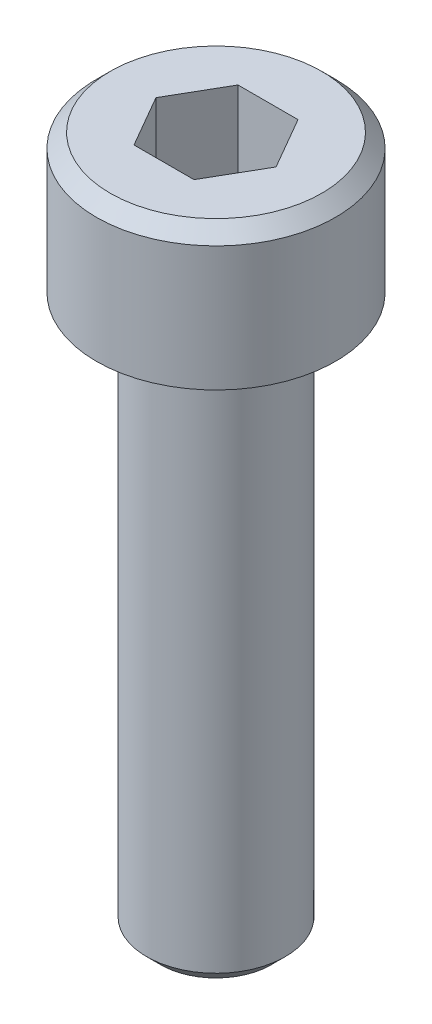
ISO-10303-21;
HEADER;
FILE_DESCRIPTION(('STEP AP214'),'2;1');
FILE_NAME('part.step','',(''),(''),'','','');
FILE_SCHEMA(('AUTOMOTIVE_DESIGN { 1 0 10303 214 1 1 1 1 }'));
ENDSEC;
DATA;
#1=APPLICATION_CONTEXT('core data for automotive mechanical design processes');
#2=APPLICATION_PROTOCOL_DEFINITION('international standard','automotive_design',2000,#1);
#3=PRODUCT_CONTEXT('',#1,'mechanical');
#4=PRODUCT('Part','Part','',(#3));
#5=PRODUCT_RELATED_PRODUCT_CATEGORY('part','',(#4));
#6=PRODUCT_DEFINITION_FORMATION('','',#4);
#7=PRODUCT_DEFINITION_CONTEXT('part definition',#1,'design');
#8=PRODUCT_DEFINITION('design','',#6,#7);
#9=PRODUCT_DEFINITION_SHAPE('','',#8);
#10=(LENGTH_UNIT() NAMED_UNIT(*) SI_UNIT(.MILLI.,.METRE.));
#11=(NAMED_UNIT(*) PLANE_ANGLE_UNIT() SI_UNIT($,.RADIAN.));
#12=(NAMED_UNIT(*) SI_UNIT($,.STERADIAN.) SOLID_ANGLE_UNIT());
#13=UNCERTAINTY_MEASURE_WITH_UNIT(LENGTH_MEASURE(1.E-05),#10,'distance_accuracy_value','');
#14=(GEOMETRIC_REPRESENTATION_CONTEXT(3) GLOBAL_UNCERTAINTY_ASSIGNED_CONTEXT((#13)) GLOBAL_UNIT_ASSIGNED_CONTEXT((#10,
#11,#12)) REPRESENTATION_CONTEXT('',''));
#15=CARTESIAN_POINT('',(0.,0.,0.));
#16=DIRECTION('',(0.,0.,1.));
#17=DIRECTION('',(1.,0.,0.));
#18=AXIS2_PLACEMENT_3D('',#15,#16,#17);
#19=CARTESIAN_POINT('',(0.,0.,0.));
#20=DIRECTION('',(0.,-1.,0.));
#21=DIRECTION('',(0.,0.,-1.));
#22=AXIS2_PLACEMENT_3D('',#19,#20,#21);
#23=PLANE('',#22);
#24=CARTESIAN_POINT('',(0.,0.,0.));
#25=DIRECTION('',(0.,-1.,0.));
#26=DIRECTION('',(0.,0.,-1.));
#27=AXIS2_PLACEMENT_3D('',#24,#25,#26);
#28=CIRCLE('',#27,1.6);
#29=CARTESIAN_POINT('',(0.,0.,-1.59999999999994));
#30=VERTEX_POINT('',#29);
#31=EDGE_CURVE('E49',#30,#30,#28,.T.);
#32=ORIENTED_EDGE('',*,*,#31,.T.);
#33=EDGE_LOOP('',(#32));
#34=FACE_BOUND('',#33,.T.);
#35=ADVANCED_FACE('F42',(#34),#23,.T.);
#36=CARTESIAN_POINT('',(0.,0.,0.));
#37=DIRECTION('',(0.,-1.,0.));
#38=DIRECTION('',(0.,0.,-1.));
#39=AXIS2_PLACEMENT_3D('',#36,#37,#38);
#40=CYLINDRICAL_SURFACE('',#39,2.);
#41=CARTESIAN_POINT('',(-2.4980018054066E-13,0.399999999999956,1.11022302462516E-13));
#42=DIRECTION('',(0.,-1.,0.));
#43=DIRECTION('',(0.,0.,-1.));
#44=AXIS2_PLACEMENT_3D('',#41,#42,#43);
#45=CIRCLE('',#44,2.);
#46=CARTESIAN_POINT('',(-2.53186360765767E-13,0.399999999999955,-1.99999999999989));
#47=VERTEX_POINT('',#46);
#48=EDGE_CURVE('E11',#47,#47,#45,.F.);
#49=ORIENTED_EDGE('',*,*,#48,.T.);
#50=EDGE_LOOP('',(#49));
#51=FACE_BOUND('',#50,.T.);
#52=CARTESIAN_POINT('',(-1.38777878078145E-13,16.0000000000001,0.));
#53=DIRECTION('',(0.,-1.,0.));
#54=DIRECTION('',(0.,0.,-1.));
#55=AXIS2_PLACEMENT_3D('',#52,#53,#54);
#56=CIRCLE('',#55,2.);
#57=CARTESIAN_POINT('',(-1.42164058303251E-13,16.0000000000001,-1.99999999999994));
#58=VERTEX_POINT('',#57);
#59=EDGE_CURVE('E152',#58,#58,#56,.T.);
#60=ORIENTED_EDGE('',*,*,#59,.T.);
#61=EDGE_LOOP('',(#60));
#62=FACE_BOUND('',#61,.T.);
#63=ADVANCED_FACE('F177',(#51,#62),#40,.T.);
#64=CARTESIAN_POINT('',(1.99999999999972,16.0000000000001,1.11022302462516E-13));
#65=DIRECTION('',(0.,-1.,0.));
#66=DIRECTION('',(0.,0.,-1.));
#67=AXIS2_PLACEMENT_3D('',#64,#65,#66);
#68=PLANE('',#67);
#69=CARTESIAN_POINT('',(-1.38777878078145E-13,16.0000000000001,0.));
#70=DIRECTION('',(0.,-1.,0.));
#71=DIRECTION('',(0.,0.,-1.));
#72=AXIS2_PLACEMENT_3D('',#69,#70,#71);
#73=CIRCLE('',#72,3.45);
#74=CARTESIAN_POINT('',(-1.44619038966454E-13,16.0000000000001,-3.44999999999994));
#75=VERTEX_POINT('',#74);
#76=EDGE_CURVE('E143',#75,#75,#73,.T.);
#77=ORIENTED_EDGE('',*,*,#76,.T.);
#78=EDGE_LOOP('',(#77));
#79=FACE_BOUND('',#78,.T.);
#80=ORIENTED_EDGE('',*,*,#59,.F.);
#81=EDGE_LOOP('',(#80));
#82=FACE_BOUND('',#81,.T.);
#83=ADVANCED_FACE('F181',(#79,#82),#68,.T.);
#84=CARTESIAN_POINT('',(0.,0.,0.));
#85=DIRECTION('',(0.,-1.,0.));
#86=DIRECTION('',(0.,0.,-1.));
#87=AXIS2_PLACEMENT_3D('',#84,#85,#86);
#88=CYLINDRICAL_SURFACE('',#87,3.45);
#89=CARTESIAN_POINT('',(-2.22044604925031E-13,19.6,0.));
#90=DIRECTION('',(0.,1.,0.));
#91=DIRECTION('',(0.,0.,1.));
#92=AXIS2_PLACEMENT_3D('',#89,#90,#91);
#93=CIRCLE('',#92,3.45);
#94=CARTESIAN_POINT('',(-2.16203444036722E-13,19.6,3.45));
#95=VERTEX_POINT('',#94);
#96=EDGE_CURVE('E155',#95,#95,#93,.F.);
#97=ORIENTED_EDGE('',*,*,#96,.T.);
#98=EDGE_LOOP('',(#97));
#99=FACE_BOUND('',#98,.T.);
#100=ORIENTED_EDGE('',*,*,#76,.F.);
#101=EDGE_LOOP('',(#100));
#102=FACE_BOUND('',#101,.T.);
#103=ADVANCED_FACE('F186',(#99,#102),#88,.T.);
#104=CARTESIAN_POINT('',(3.44999999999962,20.0000000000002,0.));
#105=DIRECTION('',(0.,1.,0.));
#106=DIRECTION('',(0.,0.,1.));
#107=AXIS2_PLACEMENT_3D('',#104,#105,#106);
#108=PLANE('',#107);
#109=CARTESIAN_POINT('',(-3.88578058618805E-13,20.,0.));
#110=DIRECTION('',(0.,1.,0.));
#111=DIRECTION('',(0.,0.,1.));
#112=AXIS2_PLACEMENT_3D('',#109,#110,#111);
#113=CIRCLE('',#112,3.05);
#114=CARTESIAN_POINT('',(-3.83414133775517E-13,20.,3.05));
#115=VERTEX_POINT('',#114);
#116=EDGE_CURVE('E158',#115,#115,#113,.T.);
#117=ORIENTED_EDGE('',*,*,#116,.T.);
#118=EDGE_LOOP('',(#117));
#119=FACE_BOUND('',#118,.T.);
#120=DIRECTION('',(-0.500000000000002,0.,-0.866025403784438));
#121=VECTOR('',#120,1.);
#122=CARTESIAN_POINT('',(1.73205080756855,20.0000000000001,1.11022302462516E-13));
#123=LINE('',#122,#121);
#124=CARTESIAN_POINT('',(1.73205080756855,20.0000000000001,1.11022302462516E-13));
#125=VERTEX_POINT('',#124);
#126=CARTESIAN_POINT('',(0.86602540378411,20.0000000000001,-1.50000000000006));
#127=VERTEX_POINT('',#126);
#128=EDGE_CURVE('E56',#125,#127,#123,.T.);
#129=ORIENTED_EDGE('',*,*,#128,.F.);
#130=DIRECTION('',(0.499999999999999,0.,-0.866025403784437));
#131=VECTOR('',#130,1.);
#132=CARTESIAN_POINT('',(0.866025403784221,20.,1.5));
#133=LINE('',#132,#131);
#134=CARTESIAN_POINT('',(0.866025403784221,20.,1.5));
#135=VERTEX_POINT('',#134);
#136=EDGE_CURVE('E125',#135,#125,#133,.T.);
#137=ORIENTED_EDGE('',*,*,#136,.F.);
#138=DIRECTION('',(1.,0.,0.));
#139=VECTOR('',#138,1.);
#140=CARTESIAN_POINT('',(-0.866025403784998,19.9999999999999,1.5));
#141=LINE('',#140,#139);
#142=CARTESIAN_POINT('',(-0.866025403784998,19.9999999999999,1.5));
#143=VERTEX_POINT('',#142);
#144=EDGE_CURVE('E119',#143,#135,#141,.T.);
#145=ORIENTED_EDGE('',*,*,#144,.F.);
#146=DIRECTION('',(0.500000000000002,0.,0.866025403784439));
#147=VECTOR('',#146,1.);
#148=CARTESIAN_POINT('',(-1.73205080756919,20.,0.));
#149=LINE('',#148,#147);
#150=CARTESIAN_POINT('',(-1.73205080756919,20.,0.));
#151=VERTEX_POINT('',#150);
#152=EDGE_CURVE('E117',#151,#143,#149,.T.);
#153=ORIENTED_EDGE('',*,*,#152,.F.);
#154=DIRECTION('',(-0.499999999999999,0.,0.866025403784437));
#155=VECTOR('',#154,1.);
#156=CARTESIAN_POINT('',(-0.866025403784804,20.0000000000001,-1.49999999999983));
#157=LINE('',#156,#155);
#158=CARTESIAN_POINT('',(-0.866025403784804,20.0000000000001,-1.49999999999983));
#159=VERTEX_POINT('',#158);
#160=EDGE_CURVE('E99',#159,#151,#157,.T.);
#161=ORIENTED_EDGE('',*,*,#160,.F.);
#162=DIRECTION('',(-1.,0.,0.));
#163=VECTOR('',#162,1.);
#164=CARTESIAN_POINT('',(0.86602540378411,20.0000000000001,-1.50000000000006));
#165=LINE('',#164,#163);
#166=EDGE_CURVE('E110',#127,#159,#165,.T.);
#167=ORIENTED_EDGE('',*,*,#166,.F.);
#168=EDGE_LOOP('',(#129,#137,#145,#153,#161,#167));
#169=FACE_BOUND('',#168,.T.);
#170=ADVANCED_FACE('F114',(#119,#169),#108,.T.);
#171=CARTESIAN_POINT('',(1.7320508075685,17.5,0.));
#172=DIRECTION('',(0.866025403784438,0.,-0.499999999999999));
#173=DIRECTION('',(-0.500000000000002,0.,-0.866025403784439));
#174=AXIS2_PLACEMENT_3D('',#171,#172,#173);
#175=PLANE('',#174);
#176=ORIENTED_EDGE('',*,*,#128,.T.);
#177=DIRECTION('',(0.,1.,0.));
#178=VECTOR('',#177,1.);
#179=CARTESIAN_POINT('',(0.866025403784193,17.5000000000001,-1.49999999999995));
#180=LINE('',#179,#178);
#181=CARTESIAN_POINT('',(0.866025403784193,17.5000000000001,-1.49999999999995));
#182=VERTEX_POINT('',#181);
#183=EDGE_CURVE('E107',#182,#127,#180,.T.);
#184=ORIENTED_EDGE('',*,*,#183,.F.);
#185=DIRECTION('',(-0.500000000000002,0.,-0.866025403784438));
#186=VECTOR('',#185,1.);
#187=CARTESIAN_POINT('',(1.7320508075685,17.5,0.));
#188=LINE('',#187,#186);
#189=CARTESIAN_POINT('',(1.7320508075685,17.5,0.));
#190=VERTEX_POINT('',#189);
#191=EDGE_CURVE('E127',#190,#182,#188,.T.);
#192=ORIENTED_EDGE('',*,*,#191,.F.);
#193=DIRECTION('',(0.,1.,0.));
#194=VECTOR('',#193,1.);
#195=CARTESIAN_POINT('',(1.7320508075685,17.5,0.));
#196=LINE('',#195,#194);
#197=EDGE_CURVE('E63',#190,#125,#196,.T.);
#198=ORIENTED_EDGE('',*,*,#197,.T.);
#199=EDGE_LOOP('',(#176,#184,#192,#198));
#200=FACE_BOUND('',#199,.T.);
#201=ADVANCED_FACE('F196',(#200),#175,.F.);
#202=CARTESIAN_POINT('',(0.866025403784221,17.5000000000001,1.5));
#203=DIRECTION('',(0.866025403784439,0.,0.5));
#204=DIRECTION('',(0.499999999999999,0.,-0.866025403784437));
#205=AXIS2_PLACEMENT_3D('',#202,#203,#204);
#206=PLANE('',#205);
#207=ORIENTED_EDGE('',*,*,#136,.T.);
#208=ORIENTED_EDGE('',*,*,#197,.F.);
#209=DIRECTION('',(0.499999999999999,0.,-0.866025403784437));
#210=VECTOR('',#209,1.);
#211=CARTESIAN_POINT('',(0.866025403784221,17.5000000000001,1.5));
#212=LINE('',#211,#210);
#213=CARTESIAN_POINT('',(0.866025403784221,17.5000000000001,1.5));
#214=VERTEX_POINT('',#213);
#215=EDGE_CURVE('E139',#214,#190,#212,.T.);
#216=ORIENTED_EDGE('',*,*,#215,.F.);
#217=DIRECTION('',(0.,1.,0.));
#218=VECTOR('',#217,1.);
#219=CARTESIAN_POINT('',(0.866025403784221,17.5000000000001,1.5));
#220=LINE('',#219,#218);
#221=EDGE_CURVE('E144',#214,#135,#220,.T.);
#222=ORIENTED_EDGE('',*,*,#221,.T.);
#223=EDGE_LOOP('',(#207,#208,#216,#222));
#224=FACE_BOUND('',#223,.T.);
#225=ADVANCED_FACE('F200',(#224),#206,.F.);
#226=CARTESIAN_POINT('',(-0.866025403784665,17.5,1.49999999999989));
#227=DIRECTION('',(0.,0.,0.999999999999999));
#228=DIRECTION('',(1.,0.,0.));
#229=AXIS2_PLACEMENT_3D('',#226,#227,#228);
#230=PLANE('',#229);
#231=ORIENTED_EDGE('',*,*,#144,.T.);
#232=ORIENTED_EDGE('',*,*,#221,.F.);
#233=DIRECTION('',(1.,0.,0.));
#234=VECTOR('',#233,1.);
#235=CARTESIAN_POINT('',(-0.866025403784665,17.5,1.49999999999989));
#236=LINE('',#235,#234);
#237=CARTESIAN_POINT('',(-0.866025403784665,17.5,1.49999999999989));
#238=VERTEX_POINT('',#237);
#239=EDGE_CURVE('E136',#238,#214,#236,.T.);
#240=ORIENTED_EDGE('',*,*,#239,.F.);
#241=DIRECTION('',(0.,1.,0.));
#242=VECTOR('',#241,1.);
#243=CARTESIAN_POINT('',(-0.866025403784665,17.5,1.49999999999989));
#244=LINE('',#243,#242);
#245=EDGE_CURVE('E146',#238,#143,#244,.T.);
#246=ORIENTED_EDGE('',*,*,#245,.T.);
#247=EDGE_LOOP('',(#231,#232,#240,#246));
#248=FACE_BOUND('',#247,.T.);
#249=ADVANCED_FACE('F208',(#248),#230,.F.);
#250=CARTESIAN_POINT('',(-1.73205080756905,17.5000000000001,1.66533453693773E-13));
#251=DIRECTION('',(-0.866025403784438,0.,0.499999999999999));
#252=DIRECTION('',(0.500000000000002,0.,0.866025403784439));
#253=AXIS2_PLACEMENT_3D('',#250,#251,#252);
#254=PLANE('',#253);
#255=ORIENTED_EDGE('',*,*,#152,.T.);
#256=ORIENTED_EDGE('',*,*,#245,.F.);
#257=DIRECTION('',(0.500000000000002,0.,0.866025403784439));
#258=VECTOR('',#257,1.);
#259=CARTESIAN_POINT('',(-1.73205080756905,17.5000000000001,1.66533453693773E-13));
#260=LINE('',#259,#258);
#261=CARTESIAN_POINT('',(-1.73205080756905,17.5000000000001,1.66533453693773E-13));
#262=VERTEX_POINT('',#261);
#263=EDGE_CURVE('E133',#262,#238,#260,.T.);
#264=ORIENTED_EDGE('',*,*,#263,.F.);
#265=DIRECTION('',(0.,1.,0.));
#266=VECTOR('',#265,1.);
#267=CARTESIAN_POINT('',(-1.73205080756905,17.5000000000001,1.66533453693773E-13));
#268=LINE('',#267,#266);
#269=EDGE_CURVE('E106',#262,#151,#268,.T.);
#270=ORIENTED_EDGE('',*,*,#269,.T.);
#271=EDGE_LOOP('',(#255,#256,#264,#270));
#272=FACE_BOUND('',#271,.T.);
#273=ADVANCED_FACE('F205',(#272),#254,.F.);
#274=CARTESIAN_POINT('',(-0.866025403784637,17.5,-1.50000000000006));
#275=DIRECTION('',(-0.866025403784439,0.,-0.500000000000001));
#276=DIRECTION('',(-0.499999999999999,0.,0.866025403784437));
#277=AXIS2_PLACEMENT_3D('',#274,#275,#276);
#278=PLANE('',#277);
#279=ORIENTED_EDGE('',*,*,#160,.T.);
#280=ORIENTED_EDGE('',*,*,#269,.F.);
#281=DIRECTION('',(-0.499999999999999,0.,0.866025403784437));
#282=VECTOR('',#281,1.);
#283=CARTESIAN_POINT('',(-0.866025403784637,17.5,-1.50000000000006));
#284=LINE('',#283,#282);
#285=CARTESIAN_POINT('',(-0.866025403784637,17.5,-1.50000000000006));
#286=VERTEX_POINT('',#285);
#287=EDGE_CURVE('E102',#286,#262,#284,.T.);
#288=ORIENTED_EDGE('',*,*,#287,.F.);
#289=DIRECTION('',(0.,1.,0.));
#290=VECTOR('',#289,1.);
#291=CARTESIAN_POINT('',(-0.866025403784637,17.5,-1.50000000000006));
#292=LINE('',#291,#290);
#293=EDGE_CURVE('E95',#286,#159,#292,.T.);
#294=ORIENTED_EDGE('',*,*,#293,.T.);
#295=EDGE_LOOP('',(#279,#280,#288,#294));
#296=FACE_BOUND('',#295,.T.);
#297=ADVANCED_FACE('F97',(#296),#278,.F.);
#298=CARTESIAN_POINT('',(0.866025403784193,17.5000000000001,-1.49999999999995));
#299=DIRECTION('',(0.,0.,-1.));
#300=DIRECTION('',(-1.,0.,0.));
#301=AXIS2_PLACEMENT_3D('',#298,#299,#300);
#302=PLANE('',#301);
#303=ORIENTED_EDGE('',*,*,#166,.T.);
#304=ORIENTED_EDGE('',*,*,#293,.F.);
#305=DIRECTION('',(-1.,0.,0.));
#306=VECTOR('',#305,1.);
#307=CARTESIAN_POINT('',(0.866025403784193,17.5000000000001,-1.49999999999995));
#308=LINE('',#307,#306);
#309=EDGE_CURVE('E130',#182,#286,#308,.T.);
#310=ORIENTED_EDGE('',*,*,#309,.F.);
#311=ORIENTED_EDGE('',*,*,#183,.T.);
#312=EDGE_LOOP('',(#303,#304,#310,#311));
#313=FACE_BOUND('',#312,.T.);
#314=ADVANCED_FACE('F111',(#313),#302,.F.);
#315=CARTESIAN_POINT('',(1.7320508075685,17.5,0.));
#316=DIRECTION('',(0.,-1.,0.));
#317=DIRECTION('',(0.,0.,-1.));
#318=AXIS2_PLACEMENT_3D('',#315,#316,#317);
#319=PLANE('',#318);
#320=ORIENTED_EDGE('',*,*,#191,.T.);
#321=ORIENTED_EDGE('',*,*,#309,.T.);
#322=ORIENTED_EDGE('',*,*,#287,.T.);
#323=ORIENTED_EDGE('',*,*,#263,.T.);
#324=ORIENTED_EDGE('',*,*,#239,.T.);
#325=ORIENTED_EDGE('',*,*,#215,.T.);
#326=EDGE_LOOP('',(#320,#321,#322,#323,#324,#325));
#327=FACE_BOUND('',#326,.T.);
#328=ADVANCED_FACE('F172',(#327),#319,.F.);
#329=CARTESIAN_POINT('',(-2.22044604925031E-13,19.6,0.));
#330=DIRECTION('',(0.,-1.,0.));
#331=DIRECTION('',(0.,0.,-1.));
#332=AXIS2_PLACEMENT_3D('',#329,#330,#331);
#333=CONICAL_SURFACE('',#332,3.45,0.785398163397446);
#334=ORIENTED_EDGE('',*,*,#116,.F.);
#335=EDGE_LOOP('',(#334));
#336=FACE_BOUND('',#335,.T.);
#337=ORIENTED_EDGE('',*,*,#96,.F.);
#338=EDGE_LOOP('',(#337));
#339=FACE_BOUND('',#338,.T.);
#340=ADVANCED_FACE('F166',(#336,#339),#333,.T.);
#341=CARTESIAN_POINT('',(0.,0.,0.));
#342=DIRECTION('',(0.,1.,0.));
#343=DIRECTION('',(0.,0.,1.));
#344=AXIS2_PLACEMENT_3D('',#341,#342,#343);
#345=CONICAL_SURFACE('',#344,1.6,0.785398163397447);
#346=ORIENTED_EDGE('',*,*,#48,.F.);
#347=EDGE_LOOP('',(#346));
#348=FACE_BOUND('',#347,.T.);
#349=ORIENTED_EDGE('',*,*,#31,.F.);
#350=EDGE_LOOP('',(#349));
#351=FACE_BOUND('',#350,.T.);
#352=ADVANCED_FACE('F164',(#348,#351),#345,.T.);
#353=CLOSED_SHELL('',(#35,#63,#83,#103,#170,#201,#225,#249,#273,#297,#314,#328,#340,#352));
#354=MANIFOLD_SOLID_BREP('B2',#353);
#355=ADVANCED_BREP_SHAPE_REPRESENTATION('',(#18,#354),#14);
#356=SHAPE_DEFINITION_REPRESENTATION(#9,#355);
ENDSEC;
END-ISO-10303-21;
